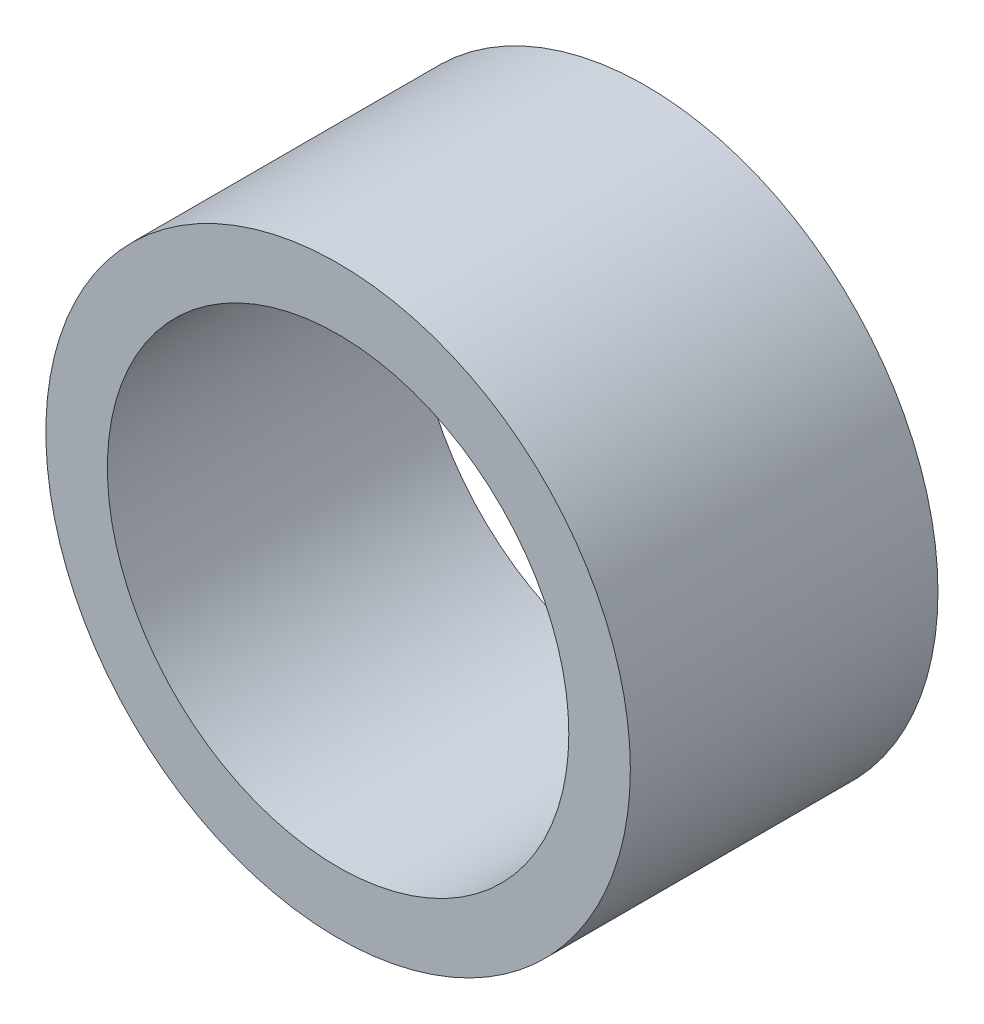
ISO-10303-21;
HEADER;
FILE_DESCRIPTION(('STEP AP214'),'2;1');
FILE_NAME('part.step','',(''),(''),'','','');
FILE_SCHEMA(('AUTOMOTIVE_DESIGN { 1 0 10303 214 1 1 1 1 }'));
ENDSEC;
DATA;
#1=APPLICATION_CONTEXT('core data for automotive mechanical design processes');
#2=APPLICATION_PROTOCOL_DEFINITION('international standard','automotive_design',2000,#1);
#3=PRODUCT_CONTEXT('',#1,'mechanical');
#4=PRODUCT('Part','Part','',(#3));
#5=PRODUCT_RELATED_PRODUCT_CATEGORY('part','',(#4));
#6=PRODUCT_DEFINITION_FORMATION('','',#4);
#7=PRODUCT_DEFINITION_CONTEXT('part definition',#1,'design');
#8=PRODUCT_DEFINITION('design','',#6,#7);
#9=PRODUCT_DEFINITION_SHAPE('','',#8);
#10=(LENGTH_UNIT() NAMED_UNIT(*) SI_UNIT(.MILLI.,.METRE.));
#11=(NAMED_UNIT(*) PLANE_ANGLE_UNIT() SI_UNIT($,.RADIAN.));
#12=(NAMED_UNIT(*) SI_UNIT($,.STERADIAN.) SOLID_ANGLE_UNIT());
#13=UNCERTAINTY_MEASURE_WITH_UNIT(LENGTH_MEASURE(1.E-05),#10,'distance_accuracy_value','');
#14=(GEOMETRIC_REPRESENTATION_CONTEXT(3) GLOBAL_UNCERTAINTY_ASSIGNED_CONTEXT((#13)) GLOBAL_UNIT_ASSIGNED_CONTEXT((#10,
#11,#12)) REPRESENTATION_CONTEXT('',''));
#15=CARTESIAN_POINT('',(0.,0.,0.));
#16=DIRECTION('',(0.,0.,1.));
#17=DIRECTION('',(1.,0.,0.));
#18=AXIS2_PLACEMENT_3D('',#15,#16,#17);
#19=CARTESIAN_POINT('',(0.,0.,10.));
#20=DIRECTION('',(0.,0.,1.));
#21=DIRECTION('',(1.,0.,0.));
#22=AXIS2_PLACEMENT_3D('',#19,#20,#21);
#23=PLANE('',#22);
#24=CARTESIAN_POINT('',(0.,0.,10.));
#25=DIRECTION('',(0.,0.,1.));
#26=DIRECTION('',(1.,0.,0.));
#27=AXIS2_PLACEMENT_3D('',#24,#25,#26);
#28=CIRCLE('',#27,19.);
#29=CARTESIAN_POINT('',(19.,0.,10.));
#30=VERTEX_POINT('',#29);
#31=EDGE_CURVE('E10',#30,#30,#28,.T.);
#32=ORIENTED_EDGE('',*,*,#31,.T.);
#33=EDGE_LOOP('',(#32));
#34=FACE_BOUND('',#33,.T.);
#35=CARTESIAN_POINT('',(0.,0.,10.));
#36=DIRECTION('',(0.,0.,1.));
#37=DIRECTION('',(1.,0.,0.));
#38=AXIS2_PLACEMENT_3D('',#35,#36,#37);
#39=CIRCLE('',#38,15.);
#40=CARTESIAN_POINT('',(15.,0.,10.));
#41=VERTEX_POINT('',#40);
#42=EDGE_CURVE('E40',#41,#41,#39,.T.);
#43=ORIENTED_EDGE('',*,*,#42,.F.);
#44=EDGE_LOOP('',(#43));
#45=FACE_BOUND('',#44,.T.);
#46=ADVANCED_FACE('F29',(#34,#45),#23,.T.);
#47=CARTESIAN_POINT('',(0.,0.,-10.));
#48=DIRECTION('',(0.,0.,1.));
#49=DIRECTION('',(1.,0.,0.));
#50=AXIS2_PLACEMENT_3D('',#47,#48,#49);
#51=PLANE('',#50);
#52=CARTESIAN_POINT('',(0.,0.,-10.));
#53=DIRECTION('',(0.,0.,1.));
#54=DIRECTION('',(1.,0.,0.));
#55=AXIS2_PLACEMENT_3D('',#52,#53,#54);
#56=CIRCLE('',#55,19.);
#57=CARTESIAN_POINT('',(19.,0.,-10.));
#58=VERTEX_POINT('',#57);
#59=EDGE_CURVE('E33',#58,#58,#56,.T.);
#60=ORIENTED_EDGE('',*,*,#59,.F.);
#61=EDGE_LOOP('',(#60));
#62=FACE_BOUND('',#61,.T.);
#63=CARTESIAN_POINT('',(0.,0.,-10.));
#64=DIRECTION('',(0.,0.,1.));
#65=DIRECTION('',(1.,0.,0.));
#66=AXIS2_PLACEMENT_3D('',#63,#64,#65);
#67=CIRCLE('',#66,15.);
#68=CARTESIAN_POINT('',(15.,0.,-10.));
#69=VERTEX_POINT('',#68);
#70=EDGE_CURVE('E42',#69,#69,#67,.T.);
#71=ORIENTED_EDGE('',*,*,#70,.T.);
#72=EDGE_LOOP('',(#71));
#73=FACE_BOUND('',#72,.T.);
#74=ADVANCED_FACE('F52',(#62,#73),#51,.F.);
#75=CARTESIAN_POINT('',(0.,0.,10.));
#76=DIRECTION('',(0.,0.,-1.));
#77=DIRECTION('',(-1.,0.,0.));
#78=AXIS2_PLACEMENT_3D('',#75,#76,#77);
#79=CYLINDRICAL_SURFACE('',#78,19.);
#80=ORIENTED_EDGE('',*,*,#31,.F.);
#81=EDGE_LOOP('',(#80));
#82=FACE_BOUND('',#81,.T.);
#83=ORIENTED_EDGE('',*,*,#59,.T.);
#84=EDGE_LOOP('',(#83));
#85=FACE_BOUND('',#84,.T.);
#86=ADVANCED_FACE('F31',(#82,#85),#79,.T.);
#87=CARTESIAN_POINT('',(0.,0.,10.));
#88=DIRECTION('',(0.,0.,-1.));
#89=DIRECTION('',(-1.,0.,0.));
#90=AXIS2_PLACEMENT_3D('',#87,#88,#89);
#91=CYLINDRICAL_SURFACE('',#90,15.);
#92=ORIENTED_EDGE('',*,*,#42,.T.);
#93=EDGE_LOOP('',(#92));
#94=FACE_BOUND('',#93,.T.);
#95=ORIENTED_EDGE('',*,*,#70,.F.);
#96=EDGE_LOOP('',(#95));
#97=FACE_BOUND('',#96,.T.);
#98=ADVANCED_FACE('F48',(#94,#97),#91,.F.);
#99=CLOSED_SHELL('',(#46,#74,#86,#98));
#100=MANIFOLD_SOLID_BREP('B2',#99);
#101=ADVANCED_BREP_SHAPE_REPRESENTATION('',(#18,#100),#14);
#102=SHAPE_DEFINITION_REPRESENTATION(#9,#101);
ENDSEC;
END-ISO-10303-21;
